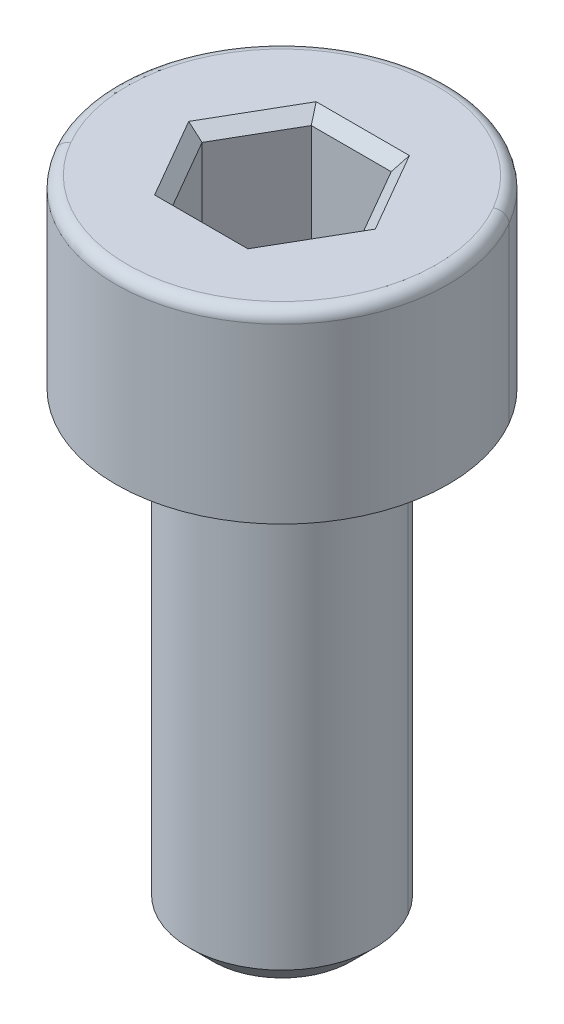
ISO-10303-21;
HEADER;
FILE_DESCRIPTION(('STEP AP214'),'2;1');
FILE_NAME('part.step','',(''),(''),'','','');
FILE_SCHEMA(('AUTOMOTIVE_DESIGN { 1 0 10303 214 1 1 1 1 }'));
ENDSEC;
DATA;
#1=APPLICATION_CONTEXT('core data for automotive mechanical design processes');
#2=APPLICATION_PROTOCOL_DEFINITION('international standard','automotive_design',2000,#1);
#3=PRODUCT_CONTEXT('',#1,'mechanical');
#4=PRODUCT('Part','Part','',(#3));
#5=PRODUCT_RELATED_PRODUCT_CATEGORY('part','',(#4));
#6=PRODUCT_DEFINITION_FORMATION('','',#4);
#7=PRODUCT_DEFINITION_CONTEXT('part definition',#1,'design');
#8=PRODUCT_DEFINITION('design','',#6,#7);
#9=PRODUCT_DEFINITION_SHAPE('','',#8);
#10=(LENGTH_UNIT() NAMED_UNIT(*) SI_UNIT(.MILLI.,.METRE.));
#11=(NAMED_UNIT(*) PLANE_ANGLE_UNIT() SI_UNIT($,.RADIAN.));
#12=(NAMED_UNIT(*) SI_UNIT($,.STERADIAN.) SOLID_ANGLE_UNIT());
#13=UNCERTAINTY_MEASURE_WITH_UNIT(LENGTH_MEASURE(1.E-05),#10,'distance_accuracy_value','');
#14=(GEOMETRIC_REPRESENTATION_CONTEXT(3) GLOBAL_UNCERTAINTY_ASSIGNED_CONTEXT((#13)) GLOBAL_UNIT_ASSIGNED_CONTEXT((#10,
#11,#12)) REPRESENTATION_CONTEXT('',''));
#15=CARTESIAN_POINT('',(0.,0.,0.));
#16=DIRECTION('',(0.,0.,1.));
#17=DIRECTION('',(1.,0.,0.));
#18=AXIS2_PLACEMENT_3D('',#15,#16,#17);
#19=CARTESIAN_POINT('',(2.89110178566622,1.21717338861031,17.2699844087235));
#20=DIRECTION('',(0.,1.,0.));
#21=DIRECTION('',(-0.866025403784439,0.,0.5));
#22=AXIS2_PLACEMENT_3D('',#19,#20,#21);
#23=CONICAL_SURFACE('',#22,1.5,0.785398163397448);
#24=DIRECTION('',(0.612372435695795,0.707106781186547,-0.353553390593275));
#25=VECTOR('',#24,1.);
#26=CARTESIAN_POINT('',(4.19013989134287,1.21717338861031,16.5199844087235));
#27=LINE('',#26,#25);
#28=CARTESIAN_POINT('',(4.19013989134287,1.21717338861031,16.5199844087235));
#29=VERTEX_POINT('',#28);
#30=CARTESIAN_POINT('',(4.6231525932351,1.71717338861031,16.2699844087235));
#31=VERTEX_POINT('',#30);
#32=EDGE_CURVE('E367',#29,#31,#27,.T.);
#33=ORIENTED_EDGE('',*,*,#32,.F.);
#34=CARTESIAN_POINT('',(2.89110178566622,1.21717338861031,17.2699844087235));
#35=DIRECTION('',(0.,-1.,0.));
#36=DIRECTION('',(0.866025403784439,0.,-0.5));
#37=AXIS2_PLACEMENT_3D('',#34,#35,#36);
#38=CIRCLE('',#37,1.5);
#39=CARTESIAN_POINT('',(1.59206367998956,1.21717338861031,18.0199844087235));
#40=VERTEX_POINT('',#39);
#41=EDGE_CURVE('E204',#40,#29,#38,.T.);
#42=ORIENTED_EDGE('',*,*,#41,.F.);
#43=DIRECTION('',(-0.612372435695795,0.707106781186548,0.353553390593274));
#44=VECTOR('',#43,1.);
#45=CARTESIAN_POINT('',(1.59206367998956,1.21717338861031,18.0199844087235));
#46=LINE('',#45,#44);
#47=CARTESIAN_POINT('',(1.15905097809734,1.71717338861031,18.2699844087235));
#48=VERTEX_POINT('',#47);
#49=EDGE_CURVE('E308',#40,#48,#46,.T.);
#50=ORIENTED_EDGE('',*,*,#49,.T.);
#51=CARTESIAN_POINT('',(2.89110178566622,1.71717338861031,17.2699844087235));
#52=DIRECTION('',(0.,1.,0.));
#53=DIRECTION('',(0.866025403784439,0.,-0.5));
#54=AXIS2_PLACEMENT_3D('',#51,#52,#53);
#55=CIRCLE('',#54,2.);
#56=EDGE_CURVE('E179',#31,#48,#55,.T.);
#57=ORIENTED_EDGE('',*,*,#56,.F.);
#58=EDGE_LOOP('',(#33,#42,#50,#57));
#59=FACE_BOUND('',#58,.T.);
#60=ADVANCED_FACE('F16',(#59),#23,.T.);
#61=CARTESIAN_POINT('',(2.89110178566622,14.9671733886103,17.2699844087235));
#62=DIRECTION('',(0.,-1.,0.));
#63=DIRECTION('',(0.866025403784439,0.,-0.5));
#64=AXIS2_PLACEMENT_3D('',#61,#62,#63);
#65=TOROIDAL_SURFACE('',#64,3.35,0.25);
#66=CARTESIAN_POINT('',(-0.0100833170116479,14.9671733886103,18.9449844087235));
#67=DIRECTION('',(0.5,0.,0.866025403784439));
#68=DIRECTION('',(-0.866025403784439,0.,0.5));
#69=AXIS2_PLACEMENT_3D('',#66,#67,#68);
#70=CIRCLE('',#69,0.25);
#71=CARTESIAN_POINT('',(-0.0100833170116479,15.2171733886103,18.9449844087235));
#72=VERTEX_POINT('',#71);
#73=CARTESIAN_POINT('',(-0.226589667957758,14.9671733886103,19.0699844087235));
#74=VERTEX_POINT('',#73);
#75=EDGE_CURVE('E307',#72,#74,#70,.T.);
#76=ORIENTED_EDGE('',*,*,#75,.F.);
#77=CARTESIAN_POINT('',(2.89110178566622,15.2171733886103,17.2699844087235));
#78=DIRECTION('',(0.,1.,0.));
#79=DIRECTION('',(0.866025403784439,0.,-0.5));
#80=AXIS2_PLACEMENT_3D('',#77,#78,#79);
#81=CIRCLE('',#80,3.35);
#82=CARTESIAN_POINT('',(5.79228688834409,15.2171733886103,15.5949844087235));
#83=VERTEX_POINT('',#82);
#84=EDGE_CURVE('E185',#83,#72,#81,.T.);
#85=ORIENTED_EDGE('',*,*,#84,.F.);
#86=CARTESIAN_POINT('',(5.79228688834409,14.9671733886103,15.5949844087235));
#87=DIRECTION('',(-0.5,0.,-0.866025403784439));
#88=DIRECTION('',(0.,1.,0.));
#89=AXIS2_PLACEMENT_3D('',#86,#87,#88);
#90=CIRCLE('',#89,0.25);
#91=CARTESIAN_POINT('',(6.0087932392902,14.9671733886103,15.4699844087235));
#92=VERTEX_POINT('',#91);
#93=EDGE_CURVE('E316',#83,#92,#90,.T.);
#94=ORIENTED_EDGE('',*,*,#93,.T.);
#95=CARTESIAN_POINT('',(2.89110178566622,14.9671733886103,17.2699844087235));
#96=DIRECTION('',(0.,-1.,0.));
#97=DIRECTION('',(0.866025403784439,0.,-0.5));
#98=AXIS2_PLACEMENT_3D('',#95,#96,#97);
#99=CIRCLE('',#98,3.6);
#100=EDGE_CURVE('E191',#74,#92,#99,.T.);
#101=ORIENTED_EDGE('',*,*,#100,.F.);
#102=EDGE_LOOP('',(#76,#85,#94,#101));
#103=FACE_BOUND('',#102,.T.);
#104=ADVANCED_FACE('F394',(#103),#65,.T.);
#105=CARTESIAN_POINT('',(1.15905097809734,14.9671733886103,17.2699844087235));
#106=DIRECTION('',(-0.612372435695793,-0.707106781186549,0.353553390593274));
#107=DIRECTION('',(0.5,0.,0.866025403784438));
#108=AXIS2_PLACEMENT_3D('',#105,#106,#107);
#109=PLANE('',#108);
#110=DIRECTION('',(-0.755928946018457,0.654653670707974,0.));
#111=VECTOR('',#110,1.);
#112=CARTESIAN_POINT('',(1.15905097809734,14.9671733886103,17.2699844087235));
#113=LINE('',#112,#111);
#114=CARTESIAN_POINT('',(1.15905097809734,14.9671733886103,17.2699844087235));
#115=VERTEX_POINT('',#114);
#116=CARTESIAN_POINT('',(0.870375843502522,15.2171733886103,17.2699844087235));
#117=VERTEX_POINT('',#116);
#118=EDGE_CURVE('E24',#115,#117,#113,.T.);
#119=ORIENTED_EDGE('',*,*,#118,.T.);
#120=DIRECTION('',(-0.5,0.,-0.866025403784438));
#121=VECTOR('',#120,1.);
#122=CARTESIAN_POINT('',(1.37555732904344,15.2171733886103,18.1449844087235));
#123=LINE('',#122,#121);
#124=CARTESIAN_POINT('',(1.88073881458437,15.2171733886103,19.0199844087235));
#125=VERTEX_POINT('',#124);
#126=EDGE_CURVE('E184',#125,#117,#123,.T.);
#127=ORIENTED_EDGE('',*,*,#126,.F.);
#128=DIRECTION('',(0.377964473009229,-0.654653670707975,-0.654653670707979));
#129=VECTOR('',#128,1.);
#130=CARTESIAN_POINT('',(2.27251221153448,14.5386019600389,18.341412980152));
#131=LINE('',#130,#129);
#132=CARTESIAN_POINT('',(2.02507638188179,14.9671733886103,18.7699844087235));
#133=VERTEX_POINT('',#132);
#134=EDGE_CURVE('E11',#125,#133,#131,.T.);
#135=ORIENTED_EDGE('',*,*,#134,.T.);
#136=DIRECTION('',(0.5,0.,0.866025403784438));
#137=VECTOR('',#136,1.);
#138=CARTESIAN_POINT('',(1.15905097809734,14.9671733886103,17.2699844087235));
#139=LINE('',#138,#137);
#140=EDGE_CURVE('E233',#115,#133,#139,.T.);
#141=ORIENTED_EDGE('',*,*,#140,.F.);
#142=EDGE_LOOP('',(#119,#127,#135,#141));
#143=FACE_BOUND('',#142,.T.);
#144=ADVANCED_FACE('F275',(#143),#109,.F.);
#145=CARTESIAN_POINT('',(2.02507638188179,14.9671733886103,18.7699844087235));
#146=DIRECTION('',(0.,-0.707106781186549,0.707106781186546));
#147=DIRECTION('',(1.,0.,0.));
#148=AXIS2_PLACEMENT_3D('',#145,#146,#147);
#149=PLANE('',#148);
#150=DIRECTION('',(-0.377964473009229,-0.654653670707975,-0.654653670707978));
#151=VECTOR('',#150,1.);
#152=CARTESIAN_POINT('',(3.75712718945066,14.9671733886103,18.7699844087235));
#153=LINE('',#152,#151);
#154=CARTESIAN_POINT('',(3.90146475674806,15.2171733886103,19.0199844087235));
#155=VERTEX_POINT('',#154);
#156=CARTESIAN_POINT('',(3.75712718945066,14.9671733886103,18.7699844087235));
#157=VERTEX_POINT('',#156);
#158=EDGE_CURVE('E155',#155,#157,#153,.T.);
#159=ORIENTED_EDGE('',*,*,#158,.T.);
#160=DIRECTION('',(1.,0.,0.));
#161=VECTOR('',#160,1.);
#162=CARTESIAN_POINT('',(2.02507638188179,14.9671733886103,18.7699844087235));
#163=LINE('',#162,#161);
#164=EDGE_CURVE('E225',#133,#157,#163,.T.);
#165=ORIENTED_EDGE('',*,*,#164,.F.);
#166=ORIENTED_EDGE('',*,*,#134,.F.);
#167=DIRECTION('',(-1.,0.,0.));
#168=VECTOR('',#167,1.);
#169=CARTESIAN_POINT('',(2.89110178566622,15.2171733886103,19.0199844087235));
#170=LINE('',#169,#168);
#171=EDGE_CURVE('E175',#155,#125,#170,.T.);
#172=ORIENTED_EDGE('',*,*,#171,.F.);
#173=EDGE_LOOP('',(#159,#165,#166,#172));
#174=FACE_BOUND('',#173,.T.);
#175=ADVANCED_FACE('F181',(#174),#149,.F.);
#176=CARTESIAN_POINT('',(2.02507638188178,14.9671733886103,15.7699844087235));
#177=DIRECTION('',(-0.612372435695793,-0.70710678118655,-0.353553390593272));
#178=DIRECTION('',(-0.5,0.,0.866025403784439));
#179=AXIS2_PLACEMENT_3D('',#176,#177,#178);
#180=PLANE('',#179);
#181=DIRECTION('',(-0.377964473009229,0.654653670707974,-0.654653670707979));
#182=VECTOR('',#181,1.);
#183=CARTESIAN_POINT('',(2.02507638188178,14.9671733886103,15.7699844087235));
#184=LINE('',#183,#182);
#185=CARTESIAN_POINT('',(2.02507638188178,14.9671733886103,15.7699844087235));
#186=VERTEX_POINT('',#185);
#187=CARTESIAN_POINT('',(1.88073881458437,15.2171733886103,15.5199844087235));
#188=VERTEX_POINT('',#187);
#189=EDGE_CURVE('E168',#186,#188,#184,.T.);
#190=ORIENTED_EDGE('',*,*,#189,.T.);
#191=DIRECTION('',(0.5,0.,-0.866025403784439));
#192=VECTOR('',#191,1.);
#193=CARTESIAN_POINT('',(1.37555732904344,15.2171733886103,16.3949844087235));
#194=LINE('',#193,#192);
#195=EDGE_CURVE('E188',#117,#188,#194,.T.);
#196=ORIENTED_EDGE('',*,*,#195,.F.);
#197=ORIENTED_EDGE('',*,*,#118,.F.);
#198=DIRECTION('',(-0.5,0.,0.866025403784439));
#199=VECTOR('',#198,1.);
#200=CARTESIAN_POINT('',(2.02507638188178,14.9671733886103,15.7699844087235));
#201=LINE('',#200,#199);
#202=EDGE_CURVE('E244',#186,#115,#201,.T.);
#203=ORIENTED_EDGE('',*,*,#202,.F.);
#204=EDGE_LOOP('',(#190,#196,#197,#203));
#205=FACE_BOUND('',#204,.T.);
#206=ADVANCED_FACE('F278',(#205),#180,.F.);
#207=CARTESIAN_POINT('',(3.75712718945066,14.9671733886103,18.7699844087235));
#208=DIRECTION('',(0.612372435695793,-0.70710678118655,0.353553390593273));
#209=DIRECTION('',(0.5,0.,-0.866025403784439));
#210=AXIS2_PLACEMENT_3D('',#207,#208,#209);
#211=PLANE('',#210);
#212=DIRECTION('',(-0.755928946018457,-0.654653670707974,0.));
#213=VECTOR('',#212,1.);
#214=CARTESIAN_POINT('',(4.6231525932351,14.9671733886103,17.2699844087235));
#215=LINE('',#214,#213);
#216=CARTESIAN_POINT('',(4.91182772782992,15.2171733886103,17.2699844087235));
#217=VERTEX_POINT('',#216);
#218=CARTESIAN_POINT('',(4.6231525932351,14.9671733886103,17.2699844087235));
#219=VERTEX_POINT('',#218);
#220=EDGE_CURVE('E267',#217,#219,#215,.T.);
#221=ORIENTED_EDGE('',*,*,#220,.T.);
#222=DIRECTION('',(0.5,0.,-0.866025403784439));
#223=VECTOR('',#222,1.);
#224=CARTESIAN_POINT('',(3.75712718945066,14.9671733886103,18.7699844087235));
#225=LINE('',#224,#223);
#226=EDGE_CURVE('E161',#157,#219,#225,.T.);
#227=ORIENTED_EDGE('',*,*,#226,.F.);
#228=ORIENTED_EDGE('',*,*,#158,.F.);
#229=DIRECTION('',(-0.5,0.,0.866025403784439));
#230=VECTOR('',#229,1.);
#231=CARTESIAN_POINT('',(4.40664624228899,15.2171733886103,18.1449844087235));
#232=LINE('',#231,#230);
#233=EDGE_CURVE('E158',#217,#155,#232,.T.);
#234=ORIENTED_EDGE('',*,*,#233,.F.);
#235=EDGE_LOOP('',(#221,#227,#228,#234));
#236=FACE_BOUND('',#235,.T.);
#237=ADVANCED_FACE('F157',(#236),#211,.F.);
#238=CARTESIAN_POINT('',(3.75712718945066,14.9671733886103,15.7699844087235));
#239=DIRECTION('',(0.,-0.70710678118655,-0.707106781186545));
#240=DIRECTION('',(-1.,0.,0.));
#241=AXIS2_PLACEMENT_3D('',#238,#239,#240);
#242=PLANE('',#241);
#243=DIRECTION('',(0.377964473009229,0.654653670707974,-0.654653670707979));
#244=VECTOR('',#243,1.);
#245=CARTESIAN_POINT('',(3.75712718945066,14.9671733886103,15.7699844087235));
#246=LINE('',#245,#244);
#247=CARTESIAN_POINT('',(3.75712718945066,14.9671733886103,15.7699844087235));
#248=VERTEX_POINT('',#247);
#249=CARTESIAN_POINT('',(3.90146475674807,15.2171733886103,15.5199844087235));
#250=VERTEX_POINT('',#249);
#251=EDGE_CURVE('E34',#248,#250,#246,.T.);
#252=ORIENTED_EDGE('',*,*,#251,.T.);
#253=DIRECTION('',(1.,0.,0.));
#254=VECTOR('',#253,1.);
#255=CARTESIAN_POINT('',(2.89110178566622,15.2171733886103,15.5199844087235));
#256=LINE('',#255,#254);
#257=EDGE_CURVE('E197',#188,#250,#256,.T.);
#258=ORIENTED_EDGE('',*,*,#257,.F.);
#259=ORIENTED_EDGE('',*,*,#189,.F.);
#260=DIRECTION('',(-1.,0.,0.));
#261=VECTOR('',#260,1.);
#262=CARTESIAN_POINT('',(3.75712718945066,14.9671733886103,15.7699844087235));
#263=LINE('',#262,#261);
#264=EDGE_CURVE('E255',#248,#186,#263,.T.);
#265=ORIENTED_EDGE('',*,*,#264,.F.);
#266=EDGE_LOOP('',(#252,#258,#259,#265));
#267=FACE_BOUND('',#266,.T.);
#268=ADVANCED_FACE('F281',(#267),#242,.F.);
#269=CARTESIAN_POINT('',(4.6231525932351,14.9671733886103,17.2699844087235));
#270=DIRECTION('',(0.612372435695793,-0.70710678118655,-0.353553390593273));
#271=DIRECTION('',(-0.5,0.,-0.866025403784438));
#272=AXIS2_PLACEMENT_3D('',#269,#270,#271);
#273=PLANE('',#272);
#274=ORIENTED_EDGE('',*,*,#220,.F.);
#275=DIRECTION('',(0.5,0.,0.866025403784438));
#276=VECTOR('',#275,1.);
#277=CARTESIAN_POINT('',(4.40664624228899,15.2171733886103,16.3949844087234));
#278=LINE('',#277,#276);
#279=EDGE_CURVE('E177',#250,#217,#278,.T.);
#280=ORIENTED_EDGE('',*,*,#279,.F.);
#281=ORIENTED_EDGE('',*,*,#251,.F.);
#282=DIRECTION('',(-0.5,0.,-0.866025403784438));
#283=VECTOR('',#282,1.);
#284=CARTESIAN_POINT('',(4.6231525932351,14.9671733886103,17.2699844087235));
#285=LINE('',#284,#283);
#286=EDGE_CURVE('E262',#219,#248,#285,.T.);
#287=ORIENTED_EDGE('',*,*,#286,.F.);
#288=EDGE_LOOP('',(#274,#280,#281,#287));
#289=FACE_BOUND('',#288,.T.);
#290=ADVANCED_FACE('F283',(#289),#273,.F.);
#291=CARTESIAN_POINT('',(2.89110178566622,12.7171733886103,17.2699844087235));
#292=DIRECTION('',(0.,1.,0.));
#293=DIRECTION('',(-0.5,0.,-0.866025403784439));
#294=AXIS2_PLACEMENT_3D('',#291,#292,#293);
#295=PLANE('',#294);
#296=DIRECTION('',(0.5,0.,-0.866025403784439));
#297=VECTOR('',#296,1.);
#298=CARTESIAN_POINT('',(3.75712718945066,12.7171733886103,18.7699844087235));
#299=LINE('',#298,#297);
#300=CARTESIAN_POINT('',(3.75712718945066,12.7171733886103,18.7699844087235));
#301=VERTEX_POINT('',#300);
#302=CARTESIAN_POINT('',(4.6231525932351,12.7171733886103,17.2699844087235));
#303=VERTEX_POINT('',#302);
#304=EDGE_CURVE('E218',#301,#303,#299,.T.);
#305=ORIENTED_EDGE('',*,*,#304,.T.);
#306=DIRECTION('',(-0.5,0.,-0.866025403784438));
#307=VECTOR('',#306,1.);
#308=CARTESIAN_POINT('',(4.6231525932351,12.7171733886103,17.2699844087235));
#309=LINE('',#308,#307);
#310=CARTESIAN_POINT('',(3.75712718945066,12.7171733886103,15.7699844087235));
#311=VERTEX_POINT('',#310);
#312=EDGE_CURVE('E43',#303,#311,#309,.T.);
#313=ORIENTED_EDGE('',*,*,#312,.T.);
#314=DIRECTION('',(-1.,0.,0.));
#315=VECTOR('',#314,1.);
#316=CARTESIAN_POINT('',(3.75712718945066,12.7171733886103,15.7699844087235));
#317=LINE('',#316,#315);
#318=CARTESIAN_POINT('',(2.02507638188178,12.7171733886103,15.7699844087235));
#319=VERTEX_POINT('',#318);
#320=EDGE_CURVE('E259',#311,#319,#317,.T.);
#321=ORIENTED_EDGE('',*,*,#320,.T.);
#322=DIRECTION('',(-0.5,0.,0.866025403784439));
#323=VECTOR('',#322,1.);
#324=CARTESIAN_POINT('',(2.02507638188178,12.7171733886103,15.7699844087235));
#325=LINE('',#324,#323);
#326=CARTESIAN_POINT('',(1.15905097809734,12.7171733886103,17.2699844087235));
#327=VERTEX_POINT('',#326);
#328=EDGE_CURVE('E248',#319,#327,#325,.T.);
#329=ORIENTED_EDGE('',*,*,#328,.T.);
#330=DIRECTION('',(0.5,0.,0.866025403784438));
#331=VECTOR('',#330,1.);
#332=CARTESIAN_POINT('',(1.15905097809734,12.7171733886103,17.2699844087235));
#333=LINE('',#332,#331);
#334=CARTESIAN_POINT('',(2.02507638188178,12.7171733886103,18.7699844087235));
#335=VERTEX_POINT('',#334);
#336=EDGE_CURVE('E237',#327,#335,#333,.T.);
#337=ORIENTED_EDGE('',*,*,#336,.T.);
#338=DIRECTION('',(1.,0.,0.));
#339=VECTOR('',#338,1.);
#340=CARTESIAN_POINT('',(2.02507638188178,12.7171733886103,18.7699844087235));
#341=LINE('',#340,#339);
#342=EDGE_CURVE('E226',#335,#301,#341,.T.);
#343=ORIENTED_EDGE('',*,*,#342,.T.);
#344=EDGE_LOOP('',(#305,#313,#321,#329,#337,#343));
#345=FACE_BOUND('',#344,.T.);
#346=ADVANCED_FACE('F415',(#345),#295,.T.);
#347=CARTESIAN_POINT('',(4.6231525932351,12.7171733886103,17.2699844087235));
#348=DIRECTION('',(0.866025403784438,0.,-0.5));
#349=DIRECTION('',(-0.5,0.,-0.866025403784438));
#350=AXIS2_PLACEMENT_3D('',#347,#348,#349);
#351=PLANE('',#350);
#352=DIRECTION('',(0.,1.,0.));
#353=VECTOR('',#352,1.);
#354=CARTESIAN_POINT('',(4.6231525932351,12.7171733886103,17.2699844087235));
#355=LINE('',#354,#353);
#356=EDGE_CURVE('E212',#303,#219,#355,.T.);
#357=ORIENTED_EDGE('',*,*,#356,.T.);
#358=ORIENTED_EDGE('',*,*,#286,.T.);
#359=DIRECTION('',(0.,1.,0.));
#360=VECTOR('',#359,1.);
#361=CARTESIAN_POINT('',(3.75712718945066,12.7171733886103,15.7699844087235));
#362=LINE('',#361,#360);
#363=EDGE_CURVE('E251',#311,#248,#362,.T.);
#364=ORIENTED_EDGE('',*,*,#363,.F.);
#365=ORIENTED_EDGE('',*,*,#312,.F.);
#366=EDGE_LOOP('',(#357,#358,#364,#365));
#367=FACE_BOUND('',#366,.T.);
#368=ADVANCED_FACE('F287',(#367),#351,.F.);
#369=CARTESIAN_POINT('',(3.75712718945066,12.7171733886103,15.7699844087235));
#370=DIRECTION('',(0.,0.,-1.));
#371=DIRECTION('',(0.,1.,0.));
#372=AXIS2_PLACEMENT_3D('',#369,#370,#371);
#373=PLANE('',#372);
#374=ORIENTED_EDGE('',*,*,#363,.T.);
#375=ORIENTED_EDGE('',*,*,#264,.T.);
#376=DIRECTION('',(0.,1.,0.));
#377=VECTOR('',#376,1.);
#378=CARTESIAN_POINT('',(2.02507638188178,12.7171733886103,15.7699844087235));
#379=LINE('',#378,#377);
#380=EDGE_CURVE('E240',#319,#186,#379,.T.);
#381=ORIENTED_EDGE('',*,*,#380,.F.);
#382=ORIENTED_EDGE('',*,*,#320,.F.);
#383=EDGE_LOOP('',(#374,#375,#381,#382));
#384=FACE_BOUND('',#383,.T.);
#385=ADVANCED_FACE('F421',(#384),#373,.F.);
#386=CARTESIAN_POINT('',(2.02507638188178,12.7171733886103,15.7699844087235));
#387=DIRECTION('',(-0.866025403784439,0.,-0.5));
#388=DIRECTION('',(-0.5,0.,0.866025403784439));
#389=AXIS2_PLACEMENT_3D('',#386,#387,#388);
#390=PLANE('',#389);
#391=ORIENTED_EDGE('',*,*,#380,.T.);
#392=ORIENTED_EDGE('',*,*,#202,.T.);
#393=DIRECTION('',(0.,1.,0.));
#394=VECTOR('',#393,1.);
#395=CARTESIAN_POINT('',(1.15905097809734,12.7171733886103,17.2699844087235));
#396=LINE('',#395,#394);
#397=EDGE_CURVE('E229',#327,#115,#396,.T.);
#398=ORIENTED_EDGE('',*,*,#397,.F.);
#399=ORIENTED_EDGE('',*,*,#328,.F.);
#400=EDGE_LOOP('',(#391,#392,#398,#399));
#401=FACE_BOUND('',#400,.T.);
#402=ADVANCED_FACE('F423',(#401),#390,.F.);
#403=CARTESIAN_POINT('',(1.15905097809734,12.7171733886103,17.2699844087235));
#404=DIRECTION('',(-0.866025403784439,0.,0.5));
#405=DIRECTION('',(0.5,0.,0.866025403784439));
#406=AXIS2_PLACEMENT_3D('',#403,#404,#405);
#407=PLANE('',#406);
#408=ORIENTED_EDGE('',*,*,#397,.T.);
#409=ORIENTED_EDGE('',*,*,#140,.T.);
#410=DIRECTION('',(0.,1.,0.));
#411=VECTOR('',#410,1.);
#412=CARTESIAN_POINT('',(2.02507638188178,12.7171733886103,18.7699844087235));
#413=LINE('',#412,#411);
#414=EDGE_CURVE('E221',#335,#133,#413,.T.);
#415=ORIENTED_EDGE('',*,*,#414,.F.);
#416=ORIENTED_EDGE('',*,*,#336,.F.);
#417=EDGE_LOOP('',(#408,#409,#415,#416));
#418=FACE_BOUND('',#417,.T.);
#419=ADVANCED_FACE('F420',(#418),#407,.F.);
#420=CARTESIAN_POINT('',(2.02507638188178,12.7171733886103,18.7699844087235));
#421=DIRECTION('',(0.,0.,1.));
#422=DIRECTION('',(0.,-1.,0.));
#423=AXIS2_PLACEMENT_3D('',#420,#421,#422);
#424=PLANE('',#423);
#425=ORIENTED_EDGE('',*,*,#414,.T.);
#426=ORIENTED_EDGE('',*,*,#164,.T.);
#427=DIRECTION('',(0.,1.,0.));
#428=VECTOR('',#427,1.);
#429=CARTESIAN_POINT('',(3.75712718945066,12.7171733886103,18.7699844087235));
#430=LINE('',#429,#428);
#431=EDGE_CURVE('E207',#301,#157,#430,.T.);
#432=ORIENTED_EDGE('',*,*,#431,.F.);
#433=ORIENTED_EDGE('',*,*,#342,.F.);
#434=EDGE_LOOP('',(#425,#426,#432,#433));
#435=FACE_BOUND('',#434,.T.);
#436=ADVANCED_FACE('F294',(#435),#424,.F.);
#437=CARTESIAN_POINT('',(3.75712718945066,12.7171733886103,18.7699844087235));
#438=DIRECTION('',(0.866025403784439,0.,0.5));
#439=DIRECTION('',(0.,1.,0.));
#440=AXIS2_PLACEMENT_3D('',#437,#438,#439);
#441=PLANE('',#440);
#442=ORIENTED_EDGE('',*,*,#431,.T.);
#443=ORIENTED_EDGE('',*,*,#226,.T.);
#444=ORIENTED_EDGE('',*,*,#356,.F.);
#445=ORIENTED_EDGE('',*,*,#304,.F.);
#446=EDGE_LOOP('',(#442,#443,#444,#445));
#447=FACE_BOUND('',#446,.T.);
#448=ADVANCED_FACE('F290',(#447),#441,.F.);
#449=CARTESIAN_POINT('',(2.89110178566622,1.21717338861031,17.2699844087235));
#450=DIRECTION('',(0.,-1.,0.));
#451=DIRECTION('',(0.866025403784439,0.,-0.5));
#452=AXIS2_PLACEMENT_3D('',#449,#450,#451);
#453=PLANE('',#452);
#454=ORIENTED_EDGE('',*,*,#41,.T.);
#455=CARTESIAN_POINT('',(2.89110178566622,1.21717338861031,17.2699844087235));
#456=DIRECTION('',(0.,-1.,0.));
#457=DIRECTION('',(0.866025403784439,0.,-0.5));
#458=AXIS2_PLACEMENT_3D('',#455,#456,#457);
#459=CIRCLE('',#458,1.5);
#460=EDGE_CURVE('E373',#29,#40,#459,.T.);
#461=ORIENTED_EDGE('',*,*,#460,.T.);
#462=EDGE_LOOP('',(#454,#461));
#463=FACE_BOUND('',#462,.T.);
#464=ADVANCED_FACE('F382',(#463),#453,.T.);
#465=CARTESIAN_POINT('',(2.89110178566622,1.21717338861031,17.2699844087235));
#466=DIRECTION('',(0.,1.,0.));
#467=DIRECTION('',(-0.866025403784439,0.,0.5));
#468=AXIS2_PLACEMENT_3D('',#465,#466,#467);
#469=CYLINDRICAL_SURFACE('',#468,2.);
#470=DIRECTION('',(0.,1.,0.));
#471=VECTOR('',#470,1.);
#472=CARTESIAN_POINT('',(4.6231525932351,1.21717338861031,16.2699844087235));
#473=LINE('',#472,#471);
#474=CARTESIAN_POINT('',(4.62315259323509,11.2171733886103,16.2699844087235));
#475=VERTEX_POINT('',#474);
#476=EDGE_CURVE('E320',#31,#475,#473,.T.);
#477=ORIENTED_EDGE('',*,*,#476,.F.);
#478=ORIENTED_EDGE('',*,*,#56,.T.);
#479=DIRECTION('',(0.,1.,0.));
#480=VECTOR('',#479,1.);
#481=CARTESIAN_POINT('',(1.15905097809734,1.21717338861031,18.2699844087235));
#482=LINE('',#481,#480);
#483=CARTESIAN_POINT('',(1.15905097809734,11.2171733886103,18.2699844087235));
#484=VERTEX_POINT('',#483);
#485=EDGE_CURVE('E328',#48,#484,#482,.T.);
#486=ORIENTED_EDGE('',*,*,#485,.T.);
#487=CARTESIAN_POINT('',(2.89110178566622,11.2171733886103,17.2699844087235));
#488=DIRECTION('',(0.,-1.,0.));
#489=DIRECTION('',(0.866025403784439,0.,-0.5));
#490=AXIS2_PLACEMENT_3D('',#487,#488,#489);
#491=CIRCLE('',#490,2.);
#492=EDGE_CURVE('E302',#484,#475,#491,.T.);
#493=ORIENTED_EDGE('',*,*,#492,.T.);
#494=EDGE_LOOP('',(#477,#478,#486,#493));
#495=FACE_BOUND('',#494,.T.);
#496=ADVANCED_FACE('F352',(#495),#469,.T.);
#497=CARTESIAN_POINT('',(2.89110178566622,15.2171733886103,17.2699844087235));
#498=DIRECTION('',(0.,-1.,0.));
#499=DIRECTION('',(0.866025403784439,0.,-0.5));
#500=AXIS2_PLACEMENT_3D('',#497,#498,#499);
#501=PLANE('',#500);
#502=ORIENTED_EDGE('',*,*,#171,.T.);
#503=ORIENTED_EDGE('',*,*,#126,.T.);
#504=ORIENTED_EDGE('',*,*,#195,.T.);
#505=ORIENTED_EDGE('',*,*,#257,.T.);
#506=ORIENTED_EDGE('',*,*,#279,.T.);
#507=ORIENTED_EDGE('',*,*,#233,.T.);
#508=EDGE_LOOP('',(#502,#503,#504,#505,#506,#507));
#509=FACE_BOUND('',#508,.T.);
#510=ORIENTED_EDGE('',*,*,#84,.T.);
#511=CARTESIAN_POINT('',(2.89110178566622,15.2171733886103,17.2699844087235));
#512=DIRECTION('',(0.,1.,0.));
#513=DIRECTION('',(0.866025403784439,0.,-0.5));
#514=AXIS2_PLACEMENT_3D('',#511,#512,#513);
#515=CIRCLE('',#514,3.35);
#516=EDGE_CURVE('E304',#72,#83,#515,.T.);
#517=ORIENTED_EDGE('',*,*,#516,.T.);
#518=EDGE_LOOP('',(#510,#517));
#519=FACE_BOUND('',#518,.T.);
#520=ADVANCED_FACE('F172',(#509,#519),#501,.F.);
#521=CARTESIAN_POINT('',(2.89110178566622,11.2171733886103,17.2699844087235));
#522=DIRECTION('',(0.,1.,0.));
#523=DIRECTION('',(-0.866025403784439,0.,0.5));
#524=AXIS2_PLACEMENT_3D('',#521,#522,#523);
#525=CYLINDRICAL_SURFACE('',#524,3.6);
#526=DIRECTION('',(0.,1.,0.));
#527=VECTOR('',#526,1.);
#528=CARTESIAN_POINT('',(6.0087932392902,11.2171733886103,15.4699844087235));
#529=LINE('',#528,#527);
#530=CARTESIAN_POINT('',(6.0087932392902,11.2171733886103,15.4699844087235));
#531=VERTEX_POINT('',#530);
#532=EDGE_CURVE('E336',#531,#92,#529,.T.);
#533=ORIENTED_EDGE('',*,*,#532,.F.);
#534=CARTESIAN_POINT('',(2.89110178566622,11.2171733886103,17.2699844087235));
#535=DIRECTION('',(0.,-1.,0.));
#536=DIRECTION('',(0.866025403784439,0.,-0.5));
#537=AXIS2_PLACEMENT_3D('',#534,#535,#536);
#538=CIRCLE('',#537,3.6);
#539=CARTESIAN_POINT('',(-0.226589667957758,11.2171733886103,19.0699844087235));
#540=VERTEX_POINT('',#539);
#541=EDGE_CURVE('E341',#540,#531,#538,.T.);
#542=ORIENTED_EDGE('',*,*,#541,.F.);
#543=DIRECTION('',(0.,1.,0.));
#544=VECTOR('',#543,1.);
#545=CARTESIAN_POINT('',(-0.226589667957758,11.2171733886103,19.0699844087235));
#546=LINE('',#545,#544);
#547=EDGE_CURVE('E340',#540,#74,#546,.T.);
#548=ORIENTED_EDGE('',*,*,#547,.T.);
#549=ORIENTED_EDGE('',*,*,#100,.T.);
#550=EDGE_LOOP('',(#533,#542,#548,#549));
#551=FACE_BOUND('',#550,.T.);
#552=ADVANCED_FACE('F452',(#551),#525,.T.);
#553=CARTESIAN_POINT('',(2.89110178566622,11.2171733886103,17.2699844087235));
#554=DIRECTION('',(0.,-1.,0.));
#555=DIRECTION('',(0.866025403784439,0.,-0.5));
#556=AXIS2_PLACEMENT_3D('',#553,#554,#555);
#557=PLANE('',#556);
#558=ORIENTED_EDGE('',*,*,#492,.F.);
#559=CARTESIAN_POINT('',(2.89110178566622,11.2171733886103,17.2699844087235));
#560=DIRECTION('',(0.,-1.,0.));
#561=DIRECTION('',(0.866025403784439,0.,-0.5));
#562=AXIS2_PLACEMENT_3D('',#559,#560,#561);
#563=CIRCLE('',#562,2.);
#564=EDGE_CURVE('E324',#475,#484,#563,.T.);
#565=ORIENTED_EDGE('',*,*,#564,.F.);
#566=EDGE_LOOP('',(#558,#565));
#567=FACE_BOUND('',#566,.T.);
#568=ORIENTED_EDGE('',*,*,#541,.T.);
#569=CARTESIAN_POINT('',(2.89110178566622,11.2171733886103,17.2699844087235));
#570=DIRECTION('',(0.,-1.,0.));
#571=DIRECTION('',(0.866025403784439,0.,-0.5));
#572=AXIS2_PLACEMENT_3D('',#569,#570,#571);
#573=CIRCLE('',#572,3.6);
#574=EDGE_CURVE('E332',#531,#540,#573,.T.);
#575=ORIENTED_EDGE('',*,*,#574,.T.);
#576=EDGE_LOOP('',(#568,#575));
#577=FACE_BOUND('',#576,.T.);
#578=ADVANCED_FACE('F356',(#567,#577),#557,.T.);
#579=CARTESIAN_POINT('',(2.89110178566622,11.2171733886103,17.2699844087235));
#580=DIRECTION('',(0.,1.,0.));
#581=DIRECTION('',(-0.866025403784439,0.,0.5));
#582=AXIS2_PLACEMENT_3D('',#579,#580,#581);
#583=CYLINDRICAL_SURFACE('',#582,3.6);
#584=ORIENTED_EDGE('',*,*,#574,.F.);
#585=ORIENTED_EDGE('',*,*,#532,.T.);
#586=CARTESIAN_POINT('',(2.89110178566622,14.9671733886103,17.2699844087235));
#587=DIRECTION('',(0.,-1.,0.));
#588=DIRECTION('',(0.866025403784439,0.,-0.5));
#589=AXIS2_PLACEMENT_3D('',#586,#587,#588);
#590=CIRCLE('',#589,3.6);
#591=EDGE_CURVE('E312',#92,#74,#590,.T.);
#592=ORIENTED_EDGE('',*,*,#591,.T.);
#593=ORIENTED_EDGE('',*,*,#547,.F.);
#594=EDGE_LOOP('',(#584,#585,#592,#593));
#595=FACE_BOUND('',#594,.T.);
#596=ADVANCED_FACE('F444',(#595),#583,.T.);
#597=CARTESIAN_POINT('',(2.89110178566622,1.21717338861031,17.2699844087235));
#598=DIRECTION('',(0.,1.,0.));
#599=DIRECTION('',(-0.866025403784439,0.,0.5));
#600=AXIS2_PLACEMENT_3D('',#597,#598,#599);
#601=CYLINDRICAL_SURFACE('',#600,2.);
#602=CARTESIAN_POINT('',(2.89110178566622,1.71717338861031,17.2699844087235));
#603=DIRECTION('',(0.,1.,0.));
#604=DIRECTION('',(0.866025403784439,0.,-0.5));
#605=AXIS2_PLACEMENT_3D('',#602,#603,#604);
#606=CIRCLE('',#605,2.);
#607=EDGE_CURVE('E361',#48,#31,#606,.T.);
#608=ORIENTED_EDGE('',*,*,#607,.T.);
#609=ORIENTED_EDGE('',*,*,#476,.T.);
#610=ORIENTED_EDGE('',*,*,#564,.T.);
#611=ORIENTED_EDGE('',*,*,#485,.F.);
#612=EDGE_LOOP('',(#608,#609,#610,#611));
#613=FACE_BOUND('',#612,.T.);
#614=ADVANCED_FACE('F359',(#613),#601,.T.);
#615=CARTESIAN_POINT('',(2.89110178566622,14.9671733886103,17.2699844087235));
#616=DIRECTION('',(0.,-1.,0.));
#617=DIRECTION('',(0.866025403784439,0.,-0.5));
#618=AXIS2_PLACEMENT_3D('',#615,#616,#617);
#619=TOROIDAL_SURFACE('',#618,3.35,0.25);
#620=ORIENTED_EDGE('',*,*,#516,.F.);
#621=ORIENTED_EDGE('',*,*,#75,.T.);
#622=ORIENTED_EDGE('',*,*,#591,.F.);
#623=ORIENTED_EDGE('',*,*,#93,.F.);
#624=EDGE_LOOP('',(#620,#621,#622,#623));
#625=FACE_BOUND('',#624,.T.);
#626=ADVANCED_FACE('F439',(#625),#619,.T.);
#627=CARTESIAN_POINT('',(2.89110178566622,1.21717338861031,17.2699844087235));
#628=DIRECTION('',(0.,1.,0.));
#629=DIRECTION('',(-0.866025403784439,0.,0.5));
#630=AXIS2_PLACEMENT_3D('',#627,#628,#629);
#631=CONICAL_SURFACE('',#630,1.5,0.785398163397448);
#632=ORIENTED_EDGE('',*,*,#460,.F.);
#633=ORIENTED_EDGE('',*,*,#32,.T.);
#634=ORIENTED_EDGE('',*,*,#607,.F.);
#635=ORIENTED_EDGE('',*,*,#49,.F.);
#636=EDGE_LOOP('',(#632,#633,#634,#635));
#637=FACE_BOUND('',#636,.T.);
#638=ADVANCED_FACE('F371',(#637),#631,.T.);
#639=CLOSED_SHELL('',(#60,#104,#144,#175,#206,#237,#268,#290,#346,#368,#385,#402,#419,#436,#448,
#464,#496,#520,#552,#578,#596,#614,#626,#638));
#640=MANIFOLD_SOLID_BREP('B1',#639);
#641=ADVANCED_BREP_SHAPE_REPRESENTATION('',(#18,#640),#14);
#642=SHAPE_DEFINITION_REPRESENTATION(#9,#641);
ENDSEC;
END-ISO-10303-21;
